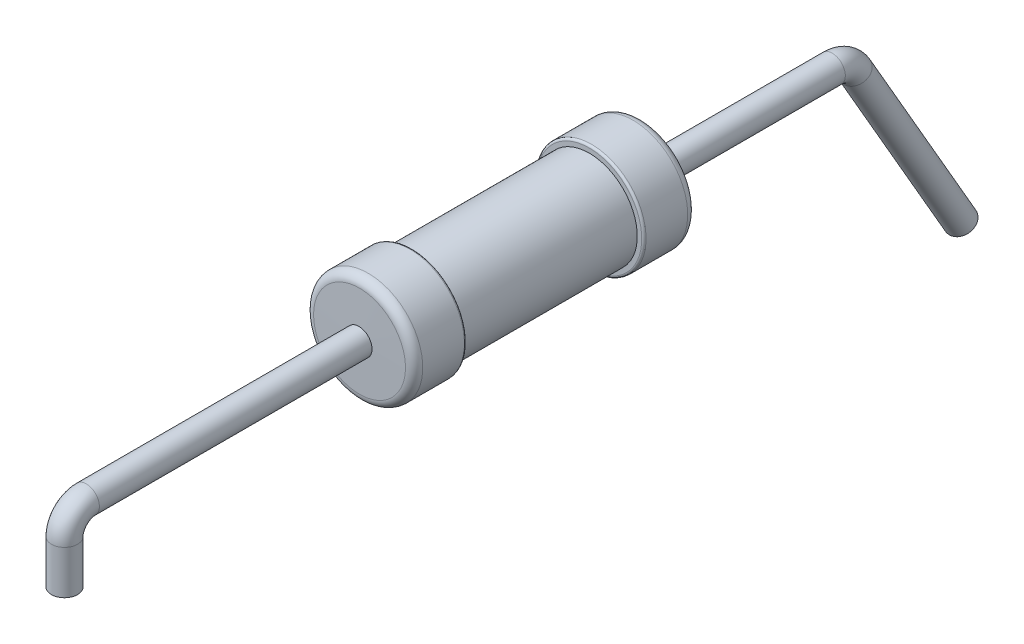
ISO-10303-21;
HEADER;
FILE_DESCRIPTION(('STEP AP214'),'2;1');
FILE_NAME('part.step','',(''),(''),'','','');
FILE_SCHEMA(('AUTOMOTIVE_DESIGN { 1 0 10303 214 1 1 1 1 }'));
ENDSEC;
DATA;
#1=APPLICATION_CONTEXT('core data for automotive mechanical design processes');
#2=APPLICATION_PROTOCOL_DEFINITION('international standard','automotive_design',2000,#1);
#3=PRODUCT_CONTEXT('',#1,'mechanical');
#4=PRODUCT('Part','Part','',(#3));
#5=PRODUCT_RELATED_PRODUCT_CATEGORY('part','',(#4));
#6=PRODUCT_DEFINITION_FORMATION('','',#4);
#7=PRODUCT_DEFINITION_CONTEXT('part definition',#1,'design');
#8=PRODUCT_DEFINITION('design','',#6,#7);
#9=PRODUCT_DEFINITION_SHAPE('','',#8);
#10=(LENGTH_UNIT() NAMED_UNIT(*) SI_UNIT(.MILLI.,.METRE.));
#11=(NAMED_UNIT(*) PLANE_ANGLE_UNIT() SI_UNIT($,.RADIAN.));
#12=(NAMED_UNIT(*) SI_UNIT($,.STERADIAN.) SOLID_ANGLE_UNIT());
#13=UNCERTAINTY_MEASURE_WITH_UNIT(LENGTH_MEASURE(1.E-05),#10,'distance_accuracy_value','');
#14=(GEOMETRIC_REPRESENTATION_CONTEXT(3) GLOBAL_UNCERTAINTY_ASSIGNED_CONTEXT((#13)) GLOBAL_UNIT_ASSIGNED_CONTEXT((#10,
#11,#12)) REPRESENTATION_CONTEXT('',''));
#15=CARTESIAN_POINT('',(0.,0.,0.));
#16=DIRECTION('',(0.,0.,1.));
#17=DIRECTION('',(1.,0.,0.));
#18=AXIS2_PLACEMENT_3D('',#15,#16,#17);
#19=CARTESIAN_POINT('',(0.,0.,4.75));
#20=DIRECTION('',(0.,0.,-1.));
#21=DIRECTION('',(-1.,0.,0.));
#22=AXIS2_PLACEMENT_3D('',#19,#20,#21);
#23=CYLINDRICAL_SURFACE('',#22,0.3);
#24=CARTESIAN_POINT('',(0.,0.,3.25));
#25=DIRECTION('',(0.,0.,-1.));
#26=DIRECTION('',(-1.,0.,0.));
#27=AXIS2_PLACEMENT_3D('',#24,#25,#26);
#28=CIRCLE('',#27,0.3);
#29=CARTESIAN_POINT('',(-0.299999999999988,0.,3.25));
#30=VERTEX_POINT('',#29);
#31=EDGE_CURVE('E12',#30,#30,#28,.T.);
#32=ORIENTED_EDGE('',*,*,#31,.F.);
#33=EDGE_LOOP('',(#32));
#34=FACE_BOUND('',#33,.T.);
#35=CARTESIAN_POINT('',(0.,0.,9.5));
#36=DIRECTION('',(0.,0.,1.));
#37=DIRECTION('',(1.,0.,0.));
#38=AXIS2_PLACEMENT_3D('',#35,#36,#37);
#39=CIRCLE('',#38,0.3);
#40=CARTESIAN_POINT('',(0.,0.299999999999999,9.5));
#41=VERTEX_POINT('',#40);
#42=EDGE_CURVE('E95',#41,#41,#39,.T.);
#43=ORIENTED_EDGE('',*,*,#42,.F.);
#44=EDGE_LOOP('',(#43));
#45=FACE_BOUND('',#44,.T.);
#46=ADVANCED_FACE('F46',(#34,#45),#23,.T.);
#47=CARTESIAN_POINT('',(0.,0.,3.23684777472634));
#48=DIRECTION('',(0.,0.,-1.));
#49=DIRECTION('',(-1.,0.,0.));
#50=AXIS2_PLACEMENT_3D('',#47,#48,#49);
#51=CONICAL_SURFACE('',#50,1.05349048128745,1.55334303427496);
#52=CARTESIAN_POINT('',(0.,0.,3.23684777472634));
#53=DIRECTION('',(0.,0.,-1.));
#54=DIRECTION('',(-1.,0.,0.));
#55=AXIS2_PLACEMENT_3D('',#52,#53,#54);
#56=CIRCLE('',#55,1.05349048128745);
#57=CARTESIAN_POINT('',(-1.05349048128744,0.,3.23684777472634));
#58=VERTEX_POINT('',#57);
#59=EDGE_CURVE('E52',#58,#58,#56,.T.);
#60=CARTESIAN_POINT('',(-0.299999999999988,0.,3.25));
#61=CARTESIAN_POINT('',(-0.307848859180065,0.,3.2498629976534));
#62=CARTESIAN_POINT('',(-0.315697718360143,0.,3.2497259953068));
#63=CARTESIAN_POINT('',(-0.331395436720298,0.,3.2494519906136));
#64=CARTESIAN_POINT('',(-0.339244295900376,0.,3.249314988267));
#65=CARTESIAN_POINT('',(-0.354942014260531,0.,3.2490409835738));
#66=CARTESIAN_POINT('',(-0.362790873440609,0.,3.24890398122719));
#67=CARTESIAN_POINT('',(-0.378488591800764,0.,3.24862997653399));
#68=CARTESIAN_POINT('',(-0.386337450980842,0.,3.24849297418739));
#69=CARTESIAN_POINT('',(-0.402035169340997,0.,3.24821896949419));
#70=CARTESIAN_POINT('',(-0.409884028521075,0.,3.24808196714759));
#71=CARTESIAN_POINT('',(-0.42558174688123,0.,3.24780796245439));
#72=CARTESIAN_POINT('',(-0.433430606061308,0.,3.24767096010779));
#73=CARTESIAN_POINT('',(-0.449128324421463,0.,3.24739695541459));
#74=CARTESIAN_POINT('',(-0.456977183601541,0.,3.24725995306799));
#75=CARTESIAN_POINT('',(-0.472674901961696,0.,3.24698594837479));
#76=CARTESIAN_POINT('',(-0.480523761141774,0.,3.24684894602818));
#77=CARTESIAN_POINT('',(-0.496221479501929,0.,3.24657494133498));
#78=CARTESIAN_POINT('',(-0.504070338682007,0.,3.24643793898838));
#79=CARTESIAN_POINT('',(-0.519768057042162,0.,3.24616393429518));
#80=CARTESIAN_POINT('',(-0.52761691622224,0.,3.24602693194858));
#81=CARTESIAN_POINT('',(-0.543314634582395,0.,3.24575292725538));
#82=CARTESIAN_POINT('',(-0.551163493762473,0.,3.24561592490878));
#83=CARTESIAN_POINT('',(-0.566861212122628,0.,3.24534192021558));
#84=CARTESIAN_POINT('',(-0.574710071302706,0.,3.24520491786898));
#85=CARTESIAN_POINT('',(-0.590407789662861,0.,3.24493091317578));
#86=CARTESIAN_POINT('',(-0.598256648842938,0.,3.24479391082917));
#87=CARTESIAN_POINT('',(-0.613954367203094,0.,3.24451990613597));
#88=CARTESIAN_POINT('',(-0.621803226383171,0.,3.24438290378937));
#89=CARTESIAN_POINT('',(-0.637500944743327,0.,3.24410889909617));
#90=CARTESIAN_POINT('',(-0.645349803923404,0.,3.24397189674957));
#91=CARTESIAN_POINT('',(-0.66104752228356,0.,3.24369789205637));
#92=CARTESIAN_POINT('',(-0.668896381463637,0.,3.24356088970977));
#93=CARTESIAN_POINT('',(-0.684594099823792,0.,3.24328688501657));
#94=CARTESIAN_POINT('',(-0.69244295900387,0.,3.24314988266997));
#95=CARTESIAN_POINT('',(-0.708140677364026,0.,3.24287587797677));
#96=CARTESIAN_POINT('',(-0.715989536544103,0.,3.24273887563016));
#97=CARTESIAN_POINT('',(-0.731687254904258,0.,3.24246487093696));
#98=CARTESIAN_POINT('',(-0.739536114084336,0.,3.24232786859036));
#99=CARTESIAN_POINT('',(-0.755233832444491,0.,3.24205386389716));
#100=CARTESIAN_POINT('',(-0.763082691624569,0.,3.24191686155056));
#101=CARTESIAN_POINT('',(-0.778780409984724,0.,3.24164285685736));
#102=CARTESIAN_POINT('',(-0.786629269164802,0.,3.24150585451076));
#103=CARTESIAN_POINT('',(-0.802326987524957,0.,3.24123184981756));
#104=CARTESIAN_POINT('',(-0.810175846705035,0.,3.24109484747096));
#105=CARTESIAN_POINT('',(-0.82587356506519,0.,3.24082084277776));
#106=CARTESIAN_POINT('',(-0.833722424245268,0.,3.24068384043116));
#107=CARTESIAN_POINT('',(-0.849420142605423,0.,3.24040983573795));
#108=CARTESIAN_POINT('',(-0.857269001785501,0.,3.24027283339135));
#109=CARTESIAN_POINT('',(-0.872966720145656,0.,3.23999882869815));
#110=CARTESIAN_POINT('',(-0.880815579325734,0.,3.23986182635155));
#111=CARTESIAN_POINT('',(-0.896513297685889,0.,3.23958782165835));
#112=CARTESIAN_POINT('',(-0.904362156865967,0.,3.23945081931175));
#113=CARTESIAN_POINT('',(-0.920059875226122,0.,3.23917681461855));
#114=CARTESIAN_POINT('',(-0.9279087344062,0.,3.23903981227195));
#115=CARTESIAN_POINT('',(-0.943606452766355,0.,3.23876580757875));
#116=CARTESIAN_POINT('',(-0.951455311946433,0.,3.23862880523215));
#117=CARTESIAN_POINT('',(-0.967153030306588,0.,3.23835480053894));
#118=CARTESIAN_POINT('',(-0.975001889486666,0.,3.23821779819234));
#119=CARTESIAN_POINT('',(-0.990699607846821,0.,3.23794379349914));
#120=CARTESIAN_POINT('',(-0.998548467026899,0.,3.23780679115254));
#121=CARTESIAN_POINT('',(-1.01424618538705,0.,3.23753278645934));
#122=CARTESIAN_POINT('',(-1.02209504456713,0.,3.23739578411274));
#123=CARTESIAN_POINT('',(-1.03779276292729,0.,3.23712177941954));
#124=CARTESIAN_POINT('',(-1.04564162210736,0.,3.23698477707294));
#125=CARTESIAN_POINT('',(-1.05349048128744,0.,3.23684777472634));
#126=B_SPLINE_CURVE_WITH_KNOTS('',3,(#60,#61,#62,#63,#64,#65,#66,#67,#68,#69,#70,#71,#72,#73,
#74,#75,#76,#77,#78,#79,#80,#81,#82,#83,#84,#85,#86,#87,#88,#89,#90,#91,#92,#93,#94,#95,#96,#97,
#98,#99,#100,#101,#102,#103,#104,#105,#106,#107,#108,#109,#110,#111,#112,#113,#114,#115,#116,
#117,#118,#119,#120,#121,#122,#123,#124,#125),.UNSPECIFIED.,.F.,.F.,(4,2,2,2,2,2,2,2,2,2,2,2,2,
2,2,2,2,2,2,2,2,2,2,2,2,2,2,2,2,2,2,2,4),(0.,0.0235501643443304,0.0471003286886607,
0.0706504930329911,0.0942006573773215,0.117750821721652,0.141300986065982,0.164851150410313,
0.188401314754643,0.211951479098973,0.235501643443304,0.259051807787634,0.282601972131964,
0.306152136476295,0.329702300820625,0.353252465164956,0.376802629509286,0.400352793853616,
0.423902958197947,0.447453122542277,0.471003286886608,0.494553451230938,0.518103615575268,
0.541653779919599,0.565203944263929,0.588754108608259,0.61230427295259,0.63585443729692,
0.659404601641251,0.682954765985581,0.706504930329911,0.730055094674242,0.753605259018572),.UNSPECIFIED.);
#127=EDGE_CURVE('BSEAM133',#30,#58,#126,.T.);
#128=ORIENTED_EDGE('',*,*,#31,.T.);
#129=ORIENTED_EDGE('',*,*,#59,.F.);
#130=ORIENTED_EDGE('',*,*,#127,.T.);
#131=ORIENTED_EDGE('',*,*,#127,.F.);
#132=EDGE_LOOP('',(#128,#130,#129,#131));
#133=FACE_BOUND('',#132,.T.);
#134=ADVANCED_FACE('F133',(#133),#51,.T.);
#135=CARTESIAN_POINT('',(0.,0.,3.03687823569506));
#136=DIRECTION('',(0.,0.,-1.));
#137=DIRECTION('',(-1.,0.,0.));
#138=AXIS2_PLACEMENT_3D('',#135,#136,#137);
#139=TOROIDAL_SURFACE('',#138,1.05,0.2);
#140=ORIENTED_EDGE('',*,*,#59,.T.);
#141=EDGE_LOOP('',(#140));
#142=FACE_BOUND('',#141,.T.);
#143=CARTESIAN_POINT('',(0.,0.,3.03687823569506));
#144=DIRECTION('',(0.,0.,-1.));
#145=DIRECTION('',(-1.,0.,0.));
#146=AXIS2_PLACEMENT_3D('',#143,#144,#145);
#147=CIRCLE('',#146,1.25);
#148=CARTESIAN_POINT('',(-1.25,0.,3.03687823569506));
#149=VERTEX_POINT('',#148);
#150=EDGE_CURVE('E56',#149,#149,#147,.T.);
#151=ORIENTED_EDGE('',*,*,#150,.F.);
#152=EDGE_LOOP('',(#151));
#153=FACE_BOUND('',#152,.T.);
#154=ADVANCED_FACE('F138',(#142,#153),#139,.T.);
#155=CARTESIAN_POINT('',(0.,0.,4.75));
#156=DIRECTION('',(0.,0.,-1.));
#157=DIRECTION('',(-1.,0.,0.));
#158=AXIS2_PLACEMENT_3D('',#155,#156,#157);
#159=CYLINDRICAL_SURFACE('',#158,1.25);
#160=ORIENTED_EDGE('',*,*,#150,.T.);
#161=EDGE_LOOP('',(#160));
#162=FACE_BOUND('',#161,.T.);
#163=CARTESIAN_POINT('',(0.,0.,2.08255255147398));
#164=DIRECTION('',(0.,0.,-1.));
#165=DIRECTION('',(-1.,0.,0.));
#166=AXIS2_PLACEMENT_3D('',#163,#164,#165);
#167=CIRCLE('',#166,1.25);
#168=CARTESIAN_POINT('',(-1.25,0.,2.08255255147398));
#169=VERTEX_POINT('',#168);
#170=EDGE_CURVE('E60',#169,#169,#167,.T.);
#171=ORIENTED_EDGE('',*,*,#170,.F.);
#172=EDGE_LOOP('',(#171));
#173=FACE_BOUND('',#172,.T.);
#174=ADVANCED_FACE('F286',(#162,#173),#159,.T.);
#175=CARTESIAN_POINT('',(0.,0.,2.08255255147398));
#176=DIRECTION('',(0.,0.,-1.));
#177=DIRECTION('',(-1.,0.,0.));
#178=AXIS2_PLACEMENT_3D('',#175,#176,#177);
#179=TOROIDAL_SURFACE('',#178,1.2,0.0500000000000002);
#180=ORIENTED_EDGE('',*,*,#170,.T.);
#181=EDGE_LOOP('',(#180));
#182=FACE_BOUND('',#181,.T.);
#183=CARTESIAN_POINT('',(0.,0.,2.03256016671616));
#184=DIRECTION('',(0.,0.,-1.));
#185=DIRECTION('',(-1.,0.,0.));
#186=AXIS2_PLACEMENT_3D('',#183,#184,#185);
#187=CIRCLE('',#186,1.20087262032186);
#188=CARTESIAN_POINT('',(-1.20087262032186,0.,2.03256016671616));
#189=VERTEX_POINT('',#188);
#190=EDGE_CURVE('E65',#189,#189,#187,.T.);
#191=ORIENTED_EDGE('',*,*,#190,.F.);
#192=EDGE_LOOP('',(#191));
#193=FACE_BOUND('',#192,.T.);
#194=ADVANCED_FACE('F276',(#182,#193),#179,.T.);
#195=CARTESIAN_POINT('',(0.,0.,2.03079942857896));
#196=DIRECTION('',(0.,0.,1.));
#197=DIRECTION('',(1.,0.,0.));
#198=AXIS2_PLACEMENT_3D('',#195,#196,#197);
#199=CONICAL_SURFACE('',#198,1.1,1.55334303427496);
#200=ORIENTED_EDGE('',*,*,#190,.T.);
#201=EDGE_LOOP('',(#200));
#202=FACE_BOUND('',#201,.T.);
#203=CARTESIAN_POINT('',(0.,0.,2.03079942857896));
#204=DIRECTION('',(0.,0.,-1.));
#205=DIRECTION('',(-1.,0.,0.));
#206=AXIS2_PLACEMENT_3D('',#203,#204,#205);
#207=CIRCLE('',#206,1.1);
#208=CARTESIAN_POINT('',(-1.1,0.,2.03079942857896));
#209=VERTEX_POINT('',#208);
#210=EDGE_CURVE('E68',#209,#209,#207,.T.);
#211=ORIENTED_EDGE('',*,*,#210,.F.);
#212=EDGE_LOOP('',(#211));
#213=FACE_BOUND('',#212,.T.);
#214=ADVANCED_FACE('F264',(#202,#213),#199,.T.);
#215=CARTESIAN_POINT('',(0.,0.,4.75));
#216=DIRECTION('',(0.,0.,-1.));
#217=DIRECTION('',(-1.,0.,0.));
#218=AXIS2_PLACEMENT_3D('',#215,#216,#217);
#219=CYLINDRICAL_SURFACE('',#218,1.1);
#220=ORIENTED_EDGE('',*,*,#210,.T.);
#221=EDGE_LOOP('',(#220));
#222=FACE_BOUND('',#221,.T.);
#223=CARTESIAN_POINT('',(0.,0.,-2.03079942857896));
#224=DIRECTION('',(0.,0.,-1.));
#225=DIRECTION('',(-1.,0.,0.));
#226=AXIS2_PLACEMENT_3D('',#223,#224,#225);
#227=CIRCLE('',#226,1.1);
#228=CARTESIAN_POINT('',(-1.1,0.,-2.03079942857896));
#229=VERTEX_POINT('',#228);
#230=EDGE_CURVE('E71',#229,#229,#227,.T.);
#231=ORIENTED_EDGE('',*,*,#230,.F.);
#232=EDGE_LOOP('',(#231));
#233=FACE_BOUND('',#232,.T.);
#234=ADVANCED_FACE('F254',(#222,#233),#219,.T.);
#235=CARTESIAN_POINT('',(0.,0.,-2.03256016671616));
#236=DIRECTION('',(0.,0.,-1.));
#237=DIRECTION('',(-1.,0.,0.));
#238=AXIS2_PLACEMENT_3D('',#235,#236,#237);
#239=CONICAL_SURFACE('',#238,1.20087262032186,1.55334303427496);
#240=ORIENTED_EDGE('',*,*,#230,.T.);
#241=EDGE_LOOP('',(#240));
#242=FACE_BOUND('',#241,.T.);
#243=CARTESIAN_POINT('',(0.,0.,-2.03256016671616));
#244=DIRECTION('',(0.,0.,-1.));
#245=DIRECTION('',(-1.,0.,0.));
#246=AXIS2_PLACEMENT_3D('',#243,#244,#245);
#247=CIRCLE('',#246,1.20087262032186);
#248=CARTESIAN_POINT('',(-1.20087262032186,0.,-2.03256016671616));
#249=VERTEX_POINT('',#248);
#250=EDGE_CURVE('E74',#249,#249,#247,.T.);
#251=ORIENTED_EDGE('',*,*,#250,.F.);
#252=EDGE_LOOP('',(#251));
#253=FACE_BOUND('',#252,.T.);
#254=ADVANCED_FACE('F243',(#242,#253),#239,.T.);
#255=CARTESIAN_POINT('',(0.,0.,-2.08255255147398));
#256=DIRECTION('',(0.,0.,-1.));
#257=DIRECTION('',(-1.,0.,0.));
#258=AXIS2_PLACEMENT_3D('',#255,#256,#257);
#259=TOROIDAL_SURFACE('',#258,1.2,0.0500000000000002);
#260=ORIENTED_EDGE('',*,*,#250,.T.);
#261=EDGE_LOOP('',(#260));
#262=FACE_BOUND('',#261,.T.);
#263=CARTESIAN_POINT('',(0.,0.,-2.08255255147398));
#264=DIRECTION('',(0.,0.,-1.));
#265=DIRECTION('',(-1.,0.,0.));
#266=AXIS2_PLACEMENT_3D('',#263,#264,#265);
#267=CIRCLE('',#266,1.25);
#268=CARTESIAN_POINT('',(-1.25,0.,-2.08255255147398));
#269=VERTEX_POINT('',#268);
#270=EDGE_CURVE('E77',#269,#269,#267,.T.);
#271=ORIENTED_EDGE('',*,*,#270,.F.);
#272=EDGE_LOOP('',(#271));
#273=FACE_BOUND('',#272,.T.);
#274=ADVANCED_FACE('F231',(#262,#273),#259,.T.);
#275=CARTESIAN_POINT('',(0.,0.,4.75));
#276=DIRECTION('',(0.,0.,-1.));
#277=DIRECTION('',(-1.,0.,0.));
#278=AXIS2_PLACEMENT_3D('',#275,#276,#277);
#279=CYLINDRICAL_SURFACE('',#278,1.25);
#280=ORIENTED_EDGE('',*,*,#270,.T.);
#281=EDGE_LOOP('',(#280));
#282=FACE_BOUND('',#281,.T.);
#283=CARTESIAN_POINT('',(0.,0.,-3.03687823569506));
#284=DIRECTION('',(0.,0.,-1.));
#285=DIRECTION('',(-1.,0.,0.));
#286=AXIS2_PLACEMENT_3D('',#283,#284,#285);
#287=CIRCLE('',#286,1.25);
#288=CARTESIAN_POINT('',(-1.25,0.,-3.03687823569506));
#289=VERTEX_POINT('',#288);
#290=EDGE_CURVE('E80',#289,#289,#287,.T.);
#291=ORIENTED_EDGE('',*,*,#290,.F.);
#292=EDGE_LOOP('',(#291));
#293=FACE_BOUND('',#292,.T.);
#294=ADVANCED_FACE('F220',(#282,#293),#279,.T.);
#295=CARTESIAN_POINT('',(0.,0.,-3.03687823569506));
#296=DIRECTION('',(0.,0.,-1.));
#297=DIRECTION('',(-1.,0.,0.));
#298=AXIS2_PLACEMENT_3D('',#295,#296,#297);
#299=TOROIDAL_SURFACE('',#298,1.05,0.2);
#300=ORIENTED_EDGE('',*,*,#290,.T.);
#301=EDGE_LOOP('',(#300));
#302=FACE_BOUND('',#301,.T.);
#303=CARTESIAN_POINT('',(0.,0.,-3.23684777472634));
#304=DIRECTION('',(0.,0.,-1.));
#305=DIRECTION('',(-1.,0.,0.));
#306=AXIS2_PLACEMENT_3D('',#303,#304,#305);
#307=CIRCLE('',#306,1.05349048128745);
#308=CARTESIAN_POINT('',(1.05349048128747,0.,-3.23684777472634));
#309=VERTEX_POINT('',#308);
#310=EDGE_CURVE('E83',#309,#309,#307,.T.);
#311=ORIENTED_EDGE('',*,*,#310,.F.);
#312=EDGE_LOOP('',(#311));
#313=FACE_BOUND('',#312,.T.);
#314=ADVANCED_FACE('F125',(#302,#313),#299,.T.);
#315=CARTESIAN_POINT('',(0.,0.,-3.25));
#316=DIRECTION('',(0.,0.,1.));
#317=DIRECTION('',(1.,0.,0.));
#318=AXIS2_PLACEMENT_3D('',#315,#316,#317);
#319=CONICAL_SURFACE('',#318,0.3,1.55334303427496);
#320=CARTESIAN_POINT('',(0.,0.,-3.25));
#321=DIRECTION('',(0.,0.,-1.));
#322=DIRECTION('',(-1.,0.,0.));
#323=AXIS2_PLACEMENT_3D('',#320,#321,#322);
#324=CIRCLE('',#323,0.3);
#325=CARTESIAN_POINT('',(0.300000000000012,0.,-3.25));
#326=VERTEX_POINT('',#325);
#327=EDGE_CURVE('E86',#326,#326,#324,.T.);
#328=CARTESIAN_POINT('',(1.05349048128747,0.,-3.23684777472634));
#329=CARTESIAN_POINT('',(1.04564162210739,0.,-3.23698477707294));
#330=CARTESIAN_POINT('',(1.03779276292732,0.,-3.23712177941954));
#331=CARTESIAN_POINT('',(1.02209504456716,0.,-3.23739578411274));
#332=CARTESIAN_POINT('',(1.01424618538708,0.,-3.23753278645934));
#333=CARTESIAN_POINT('',(0.998548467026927,0.,-3.23780679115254));
#334=CARTESIAN_POINT('',(0.990699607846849,0.,-3.23794379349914));
#335=CARTESIAN_POINT('',(0.975001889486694,0.,-3.23821779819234));
#336=CARTESIAN_POINT('',(0.967153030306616,0.,-3.23835480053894));
#337=CARTESIAN_POINT('',(0.951455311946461,0.,-3.23862880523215));
#338=CARTESIAN_POINT('',(0.943606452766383,0.,-3.23876580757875));
#339=CARTESIAN_POINT('',(0.927908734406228,0.,-3.23903981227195));
#340=CARTESIAN_POINT('',(0.92005987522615,0.,-3.23917681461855));
#341=CARTESIAN_POINT('',(0.904362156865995,0.,-3.23945081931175));
#342=CARTESIAN_POINT('',(0.896513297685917,0.,-3.23958782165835));
#343=CARTESIAN_POINT('',(0.880815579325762,0.,-3.23986182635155));
#344=CARTESIAN_POINT('',(0.872966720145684,0.,-3.23999882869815));
#345=CARTESIAN_POINT('',(0.857269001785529,0.,-3.24027283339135));
#346=CARTESIAN_POINT('',(0.849420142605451,0.,-3.24040983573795));
#347=CARTESIAN_POINT('',(0.833722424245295,0.,-3.24068384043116));
#348=CARTESIAN_POINT('',(0.825873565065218,0.,-3.24082084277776));
#349=CARTESIAN_POINT('',(0.810175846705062,0.,-3.24109484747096));
#350=CARTESIAN_POINT('',(0.802326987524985,0.,-3.24123184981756));
#351=CARTESIAN_POINT('',(0.786629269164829,0.,-3.24150585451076));
#352=CARTESIAN_POINT('',(0.778780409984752,0.,-3.24164285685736));
#353=CARTESIAN_POINT('',(0.763082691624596,0.,-3.24191686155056));
#354=CARTESIAN_POINT('',(0.755233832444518,0.,-3.24205386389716));
#355=CARTESIAN_POINT('',(0.739536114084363,0.,-3.24232786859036));
#356=CARTESIAN_POINT('',(0.731687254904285,0.,-3.24246487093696));
#357=CARTESIAN_POINT('',(0.71598953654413,0.,-3.24273887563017));
#358=CARTESIAN_POINT('',(0.708140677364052,0.,-3.24287587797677));
#359=CARTESIAN_POINT('',(0.692442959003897,0.,-3.24314988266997));
#360=CARTESIAN_POINT('',(0.684594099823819,0.,-3.24328688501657));
#361=CARTESIAN_POINT('',(0.668896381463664,0.,-3.24356088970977));
#362=CARTESIAN_POINT('',(0.661047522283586,0.,-3.24369789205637));
#363=CARTESIAN_POINT('',(0.645349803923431,0.,-3.24397189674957));
#364=CARTESIAN_POINT('',(0.637500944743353,0.,-3.24410889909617));
#365=CARTESIAN_POINT('',(0.621803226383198,0.,-3.24438290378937));
#366=CARTESIAN_POINT('',(0.61395436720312,0.,-3.24451990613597));
#367=CARTESIAN_POINT('',(0.598256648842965,0.,-3.24479391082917));
#368=CARTESIAN_POINT('',(0.590407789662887,0.,-3.24493091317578));
#369=CARTESIAN_POINT('',(0.574710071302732,0.,-3.24520491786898));
#370=CARTESIAN_POINT('',(0.566861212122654,0.,-3.24534192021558));
#371=CARTESIAN_POINT('',(0.551163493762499,0.,-3.24561592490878));
#372=CARTESIAN_POINT('',(0.543314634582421,0.,-3.24575292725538));
#373=CARTESIAN_POINT('',(0.527616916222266,0.,-3.24602693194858));
#374=CARTESIAN_POINT('',(0.519768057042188,0.,-3.24616393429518));
#375=CARTESIAN_POINT('',(0.504070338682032,0.,-3.24643793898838));
#376=CARTESIAN_POINT('',(0.496221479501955,0.,-3.24657494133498));
#377=CARTESIAN_POINT('',(0.480523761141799,0.,-3.24684894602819));
#378=CARTESIAN_POINT('',(0.472674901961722,0.,-3.24698594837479));
#379=CARTESIAN_POINT('',(0.456977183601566,0.,-3.24725995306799));
#380=CARTESIAN_POINT('',(0.449128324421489,0.,-3.24739695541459));
#381=CARTESIAN_POINT('',(0.433430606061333,0.,-3.24767096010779));
#382=CARTESIAN_POINT('',(0.425581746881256,0.,-3.24780796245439));
#383=CARTESIAN_POINT('',(0.4098840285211,0.,-3.24808196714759));
#384=CARTESIAN_POINT('',(0.402035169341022,0.,-3.24821896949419));
#385=CARTESIAN_POINT('',(0.386337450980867,0.,-3.24849297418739));
#386=CARTESIAN_POINT('',(0.378488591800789,0.,-3.24862997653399));
#387=CARTESIAN_POINT('',(0.362790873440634,0.,-3.24890398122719));
#388=CARTESIAN_POINT('',(0.354942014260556,0.,-3.2490409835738));
#389=CARTESIAN_POINT('',(0.339244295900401,0.,-3.249314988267));
#390=CARTESIAN_POINT('',(0.331395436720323,0.,-3.2494519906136));
#391=CARTESIAN_POINT('',(0.315697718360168,0.,-3.2497259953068));
#392=CARTESIAN_POINT('',(0.30784885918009,0.,-3.2498629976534));
#393=CARTESIAN_POINT('',(0.300000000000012,0.,-3.25));
#394=B_SPLINE_CURVE_WITH_KNOTS('',3,(#328,#329,#330,#331,#332,#333,#334,#335,#336,#337,#338,
#339,#340,#341,#342,#343,#344,#345,#346,#347,#348,#349,#350,#351,#352,#353,#354,#355,#356,#357,
#358,#359,#360,#361,#362,#363,#364,#365,#366,#367,#368,#369,#370,#371,#372,#373,#374,#375,#376,
#377,#378,#379,#380,#381,#382,#383,#384,#385,#386,#387,#388,#389,#390,#391,#392,#393),
.UNSPECIFIED.,.F.,.F.,(4,2,2,2,2,2,2,2,2,2,2,2,2,2,2,2,2,2,2,2,2,2,2,2,2,2,2,2,2,2,2,2,4),(0.,
0.0235501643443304,0.0471003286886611,0.0706504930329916,0.094200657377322,0.117750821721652,
0.141300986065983,0.164851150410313,0.188401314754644,0.211951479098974,0.235501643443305,
0.259051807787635,0.282601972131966,0.306152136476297,0.329702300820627,0.353252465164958,
0.376802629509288,0.400352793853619,0.423902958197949,0.44745312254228,0.47100328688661,
0.494553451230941,0.518103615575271,0.541653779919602,0.565203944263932,0.588754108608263,
0.612304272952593,0.635854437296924,0.659404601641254,0.682954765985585,0.706504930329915,
0.730055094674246,0.753605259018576),.UNSPECIFIED.);
#395=EDGE_CURVE('BSEAM113',#309,#326,#394,.T.);
#396=ORIENTED_EDGE('',*,*,#310,.T.);
#397=ORIENTED_EDGE('',*,*,#327,.F.);
#398=ORIENTED_EDGE('',*,*,#395,.T.);
#399=ORIENTED_EDGE('',*,*,#395,.F.);
#400=EDGE_LOOP('',(#396,#398,#397,#399));
#401=FACE_BOUND('',#400,.T.);
#402=ADVANCED_FACE('F113',(#401),#319,.T.);
#403=CARTESIAN_POINT('',(0.,0.,4.75));
#404=DIRECTION('',(0.,0.,-1.));
#405=DIRECTION('',(-1.,0.,0.));
#406=AXIS2_PLACEMENT_3D('',#403,#404,#405);
#407=CYLINDRICAL_SURFACE('',#406,0.3);
#408=ORIENTED_EDGE('',*,*,#327,.T.);
#409=EDGE_LOOP('',(#408));
#410=FACE_BOUND('',#409,.T.);
#411=CARTESIAN_POINT('',(0.,0.,-7.6));
#412=DIRECTION('',(0.,0.,-1.));
#413=DIRECTION('',(-1.,0.,0.));
#414=AXIS2_PLACEMENT_3D('',#411,#412,#413);
#415=CIRCLE('',#414,0.3);
#416=CARTESIAN_POINT('',(0.,0.3,-7.6));
#417=VERTEX_POINT('',#416);
#418=EDGE_CURVE('E104',#417,#417,#415,.T.);
#419=ORIENTED_EDGE('',*,*,#418,.F.);
#420=EDGE_LOOP('',(#419));
#421=FACE_BOUND('',#420,.T.);
#422=ADVANCED_FACE('F110',(#410,#421),#407,.T.);
#423=CARTESIAN_POINT('',(0.,-1.5,10.));
#424=DIRECTION('',(0.,-1.,0.));
#425=DIRECTION('',(1.,0.,0.));
#426=AXIS2_PLACEMENT_3D('',#423,#424,#425);
#427=PLANE('',#426);
#428=CARTESIAN_POINT('',(0.,-1.5,10.));
#429=DIRECTION('',(0.,-1.,0.));
#430=DIRECTION('',(1.,0.,0.));
#431=AXIS2_PLACEMENT_3D('',#428,#429,#430);
#432=CIRCLE('',#431,0.3);
#433=CARTESIAN_POINT('',(0.3,-1.5,10.));
#434=VERTEX_POINT('',#433);
#435=EDGE_CURVE('E89',#434,#434,#432,.T.);
#436=ORIENTED_EDGE('',*,*,#435,.T.);
#437=EDGE_LOOP('',(#436));
#438=FACE_BOUND('',#437,.T.);
#439=ADVANCED_FACE('F112',(#438),#427,.T.);
#440=CARTESIAN_POINT('',(0.,-0.5,9.5));
#441=DIRECTION('',(1.,0.,0.));
#442=DIRECTION('',(0.,0.,-1.));
#443=AXIS2_PLACEMENT_3D('',#440,#441,#442);
#444=TOROIDAL_SURFACE('',#443,0.5,0.3);
#445=CARTESIAN_POINT('',(0.,-0.5,10.));
#446=DIRECTION('',(0.,-1.,0.));
#447=DIRECTION('',(1.,0.,0.));
#448=AXIS2_PLACEMENT_3D('',#445,#446,#447);
#449=CIRCLE('',#448,0.3);
#450=CARTESIAN_POINT('',(0.,-0.5,10.3));
#451=VERTEX_POINT('',#450);
#452=EDGE_CURVE('E92',#451,#451,#449,.T.);
#453=CARTESIAN_POINT('',(0.,-0.5,9.5));
#454=DIRECTION('',(1.,0.,0.));
#455=DIRECTION('',(0.,0.,-1.));
#456=AXIS2_PLACEMENT_3D('',#453,#454,#455);
#457=CIRCLE('',#456,0.8);
#458=EDGE_CURVE('',#41,#451,#457,.T.);
#459=ORIENTED_EDGE('',*,*,#42,.T.);
#460=ORIENTED_EDGE('',*,*,#452,.F.);
#461=ORIENTED_EDGE('',*,*,#458,.T.);
#462=ORIENTED_EDGE('',*,*,#458,.F.);
#463=EDGE_LOOP('',(#459,#461,#460,#462));
#464=FACE_BOUND('',#463,.T.);
#465=ADVANCED_FACE('F121',(#464),#444,.T.);
#466=CARTESIAN_POINT('',(0.,-0.5,10.));
#467=DIRECTION('',(0.,-1.,0.));
#468=DIRECTION('',(0.,0.,-1.));
#469=AXIS2_PLACEMENT_3D('',#466,#467,#468);
#470=CYLINDRICAL_SURFACE('',#469,0.3);
#471=ORIENTED_EDGE('',*,*,#435,.F.);
#472=EDGE_LOOP('',(#471));
#473=FACE_BOUND('',#472,.T.);
#474=ORIENTED_EDGE('',*,*,#452,.T.);
#475=EDGE_LOOP('',(#474));
#476=FACE_BOUND('',#475,.T.);
#477=ADVANCED_FACE('F116',(#473,#476),#470,.T.);
#478=CARTESIAN_POINT('',(0.,-4.5,-10.5444863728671));
#479=DIRECTION('',(0.,-0.86602540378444,-0.499999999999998));
#480=DIRECTION('',(-1.,0.,0.));
#481=AXIS2_PLACEMENT_3D('',#478,#479,#480);
#482=PLANE('',#481);
#483=CARTESIAN_POINT('',(0.,-4.5,-10.5444863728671));
#484=DIRECTION('',(0.,-0.86602540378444,-0.499999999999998));
#485=DIRECTION('',(-1.,0.,0.));
#486=AXIS2_PLACEMENT_3D('',#483,#484,#485);
#487=CIRCLE('',#486,0.3);
#488=CARTESIAN_POINT('',(-0.3,-4.5,-10.5444863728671));
#489=VERTEX_POINT('',#488);
#490=EDGE_CURVE('E98',#489,#489,#487,.T.);
#491=ORIENTED_EDGE('',*,*,#490,.T.);
#492=EDGE_LOOP('',(#491));
#493=FACE_BOUND('',#492,.T.);
#494=ADVANCED_FACE('F129',(#493),#482,.T.);
#495=CARTESIAN_POINT('',(0.,-0.6,-7.6));
#496=DIRECTION('',(-1.,0.,0.));
#497=DIRECTION('',(0.,0.,1.));
#498=AXIS2_PLACEMENT_3D('',#495,#496,#497);
#499=TOROIDAL_SURFACE('',#498,0.6,0.3);
#500=CARTESIAN_POINT('',(0.,-0.300000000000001,-8.11961524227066));
#501=DIRECTION('',(0.,-0.86602540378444,-0.499999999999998));
#502=DIRECTION('',(-1.,0.,0.));
#503=AXIS2_PLACEMENT_3D('',#500,#501,#502);
#504=CIRCLE('',#503,0.3);
#505=CARTESIAN_POINT('',(0.,-0.150000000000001,-8.379422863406));
#506=VERTEX_POINT('',#505);
#507=EDGE_CURVE('E101',#506,#506,#504,.T.);
#508=CARTESIAN_POINT('',(0.,-0.6,-7.6));
#509=DIRECTION('',(-1.,0.,0.));
#510=DIRECTION('',(0.,0.,1.));
#511=AXIS2_PLACEMENT_3D('',#508,#509,#510);
#512=CIRCLE('',#511,0.9);
#513=EDGE_CURVE('',#417,#506,#512,.T.);
#514=ORIENTED_EDGE('',*,*,#418,.T.);
#515=ORIENTED_EDGE('',*,*,#507,.F.);
#516=ORIENTED_EDGE('',*,*,#513,.T.);
#517=ORIENTED_EDGE('',*,*,#513,.F.);
#518=EDGE_LOOP('',(#514,#516,#515,#517));
#519=FACE_BOUND('',#518,.T.);
#520=ADVANCED_FACE('F108',(#519),#499,.T.);
#521=CARTESIAN_POINT('',(0.,-0.300000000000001,-8.11961524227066));
#522=DIRECTION('',(0.,-0.86602540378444,-0.499999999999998));
#523=DIRECTION('',(0.,0.499999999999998,-0.86602540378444));
#524=AXIS2_PLACEMENT_3D('',#521,#522,#523);
#525=CYLINDRICAL_SURFACE('',#524,0.3);
#526=ORIENTED_EDGE('',*,*,#490,.F.);
#527=EDGE_LOOP('',(#526));
#528=FACE_BOUND('',#527,.T.);
#529=ORIENTED_EDGE('',*,*,#507,.T.);
#530=EDGE_LOOP('',(#529));
#531=FACE_BOUND('',#530,.T.);
#532=ADVANCED_FACE('F124',(#528,#531),#525,.T.);
#533=CLOSED_SHELL('',(#46,#134,#154,#174,#194,#214,#234,#254,#274,#294,#314,#402,#422,#439,#465,
#477,#494,#520,#532));
#534=MANIFOLD_SOLID_BREP('B2',#533);
#535=ADVANCED_BREP_SHAPE_REPRESENTATION('',(#18,#534),#14);
#536=SHAPE_DEFINITION_REPRESENTATION(#9,#535);
ENDSEC;
END-ISO-10303-21;
